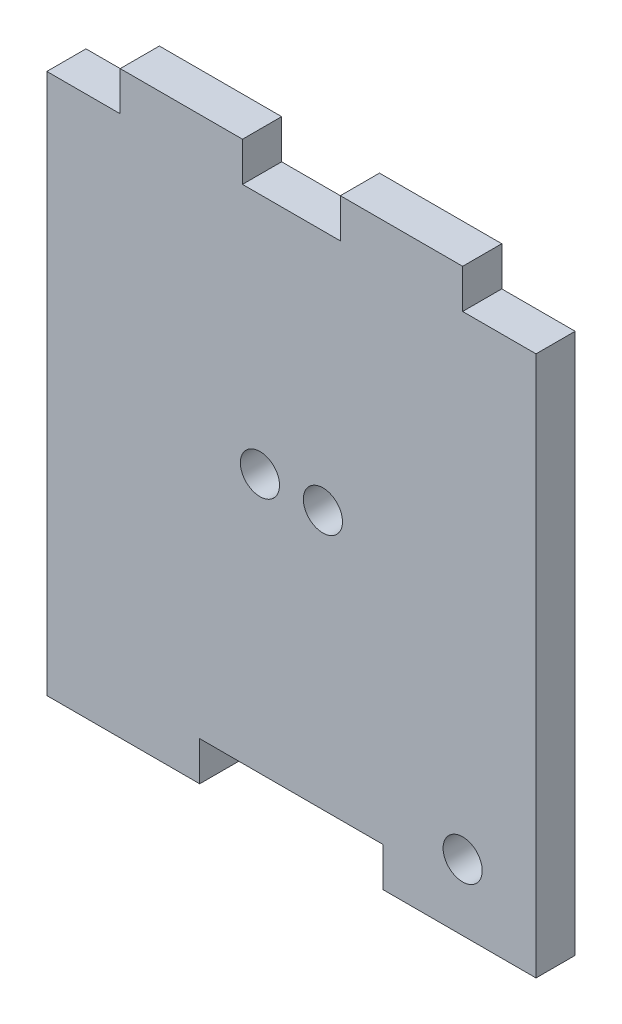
ISO-10303-21;
HEADER;
FILE_DESCRIPTION(('STEP AP214'),'2;1');
FILE_NAME('part.step','',(''),(''),'','','');
FILE_SCHEMA(('AUTOMOTIVE_DESIGN { 1 0 10303 214 1 1 1 1 }'));
ENDSEC;
DATA;
#1=APPLICATION_CONTEXT('core data for automotive mechanical design processes');
#2=APPLICATION_PROTOCOL_DEFINITION('international standard','automotive_design',2000,#1);
#3=PRODUCT_CONTEXT('',#1,'mechanical');
#4=PRODUCT('Part','Part','',(#3));
#5=PRODUCT_RELATED_PRODUCT_CATEGORY('part','',(#4));
#6=PRODUCT_DEFINITION_FORMATION('','',#4);
#7=PRODUCT_DEFINITION_CONTEXT('part definition',#1,'design');
#8=PRODUCT_DEFINITION('design','',#6,#7);
#9=PRODUCT_DEFINITION_SHAPE('','',#8);
#10=(LENGTH_UNIT() NAMED_UNIT(*) SI_UNIT(.MILLI.,.METRE.));
#11=(NAMED_UNIT(*) PLANE_ANGLE_UNIT() SI_UNIT($,.RADIAN.));
#12=(NAMED_UNIT(*) SI_UNIT($,.STERADIAN.) SOLID_ANGLE_UNIT());
#13=UNCERTAINTY_MEASURE_WITH_UNIT(LENGTH_MEASURE(1.E-05),#10,'distance_accuracy_value','');
#14=(GEOMETRIC_REPRESENTATION_CONTEXT(3) GLOBAL_UNCERTAINTY_ASSIGNED_CONTEXT((#13)) GLOBAL_UNIT_ASSIGNED_CONTEXT((#10,
#11,#12)) REPRESENTATION_CONTEXT('',''));
#15=CARTESIAN_POINT('',(0.,0.,0.));
#16=DIRECTION('',(0.,0.,1.));
#17=DIRECTION('',(1.,0.,0.));
#18=AXIS2_PLACEMENT_3D('',#15,#16,#17);
#19=CARTESIAN_POINT('',(30.,0.,16.));
#20=DIRECTION('',(-1.,0.,0.));
#21=DIRECTION('',(0.,0.,1.));
#22=AXIS2_PLACEMENT_3D('',#19,#20,#21);
#23=PLANE('',#22);
#24=DIRECTION('',(0.,1.,0.));
#25=VECTOR('',#24,1.);
#26=CARTESIAN_POINT('',(30.,0.,0.));
#27=LINE('',#26,#25);
#28=CARTESIAN_POINT('',(30.,221.,0.));
#29=VERTEX_POINT('',#28);
#30=CARTESIAN_POINT('',(30.,237.,0.));
#31=VERTEX_POINT('',#30);
#32=EDGE_CURVE('E240',#29,#31,#27,.T.);
#33=ORIENTED_EDGE('',*,*,#32,.F.);
#34=DIRECTION('',(0.,0.,-1.));
#35=VECTOR('',#34,1.);
#36=CARTESIAN_POINT('',(30.,221.,16.));
#37=LINE('',#36,#35);
#38=CARTESIAN_POINT('',(30.,221.,16.));
#39=VERTEX_POINT('',#38);
#40=EDGE_CURVE('E11',#39,#29,#37,.T.);
#41=ORIENTED_EDGE('',*,*,#40,.F.);
#42=DIRECTION('',(0.,1.,0.));
#43=VECTOR('',#42,1.);
#44=CARTESIAN_POINT('',(30.,0.,16.));
#45=LINE('',#44,#43);
#46=CARTESIAN_POINT('',(30.,237.,16.));
#47=VERTEX_POINT('',#46);
#48=EDGE_CURVE('E186',#39,#47,#45,.T.);
#49=ORIENTED_EDGE('',*,*,#48,.T.);
#50=DIRECTION('',(0.,0.,-1.));
#51=VECTOR('',#50,1.);
#52=CARTESIAN_POINT('',(30.,237.,16.));
#53=LINE('',#52,#51);
#54=EDGE_CURVE('E53',#47,#31,#53,.T.);
#55=ORIENTED_EDGE('',*,*,#54,.T.);
#56=EDGE_LOOP('',(#33,#41,#49,#55));
#57=FACE_BOUND('',#56,.T.);
#58=ADVANCED_FACE('F37',(#57),#23,.T.);
#59=CARTESIAN_POINT('',(0.,221.,16.));
#60=DIRECTION('',(0.,1.,0.));
#61=DIRECTION('',(0.,0.,1.));
#62=AXIS2_PLACEMENT_3D('',#59,#60,#61);
#63=PLANE('',#62);
#64=DIRECTION('',(1.,0.,0.));
#65=VECTOR('',#64,1.);
#66=CARTESIAN_POINT('',(0.,221.,0.));
#67=LINE('',#66,#65);
#68=CARTESIAN_POINT('',(0.,221.,0.));
#69=VERTEX_POINT('',#68);
#70=EDGE_CURVE('E237',#69,#29,#67,.T.);
#71=ORIENTED_EDGE('',*,*,#70,.F.);
#72=DIRECTION('',(0.,0.,-1.));
#73=VECTOR('',#72,1.);
#74=CARTESIAN_POINT('',(0.,221.,16.));
#75=LINE('',#74,#73);
#76=CARTESIAN_POINT('',(0.,221.,16.));
#77=VERTEX_POINT('',#76);
#78=EDGE_CURVE('E45',#77,#69,#75,.T.);
#79=ORIENTED_EDGE('',*,*,#78,.F.);
#80=DIRECTION('',(1.,0.,0.));
#81=VECTOR('',#80,1.);
#82=CARTESIAN_POINT('',(0.,221.,16.));
#83=LINE('',#82,#81);
#84=EDGE_CURVE('E176',#77,#39,#83,.T.);
#85=ORIENTED_EDGE('',*,*,#84,.T.);
#86=ORIENTED_EDGE('',*,*,#40,.T.);
#87=EDGE_LOOP('',(#71,#79,#85,#86));
#88=FACE_BOUND('',#87,.T.);
#89=ADVANCED_FACE('F238',(#88),#63,.T.);
#90=CARTESIAN_POINT('',(0.,0.,16.));
#91=DIRECTION('',(-1.,0.,0.));
#92=DIRECTION('',(0.,0.,1.));
#93=AXIS2_PLACEMENT_3D('',#90,#91,#92);
#94=PLANE('',#93);
#95=DIRECTION('',(0.,1.,0.));
#96=VECTOR('',#95,1.);
#97=CARTESIAN_POINT('',(0.,0.,0.));
#98=LINE('',#97,#96);
#99=CARTESIAN_POINT('',(0.,0.,0.));
#100=VERTEX_POINT('',#99);
#101=EDGE_CURVE('E234',#100,#69,#98,.T.);
#102=ORIENTED_EDGE('',*,*,#101,.F.);
#103=DIRECTION('',(0.,0.,-1.));
#104=VECTOR('',#103,1.);
#105=CARTESIAN_POINT('',(0.,0.,16.));
#106=LINE('',#105,#104);
#107=CARTESIAN_POINT('',(0.,0.,16.));
#108=VERTEX_POINT('',#107);
#109=EDGE_CURVE('E228',#108,#100,#106,.T.);
#110=ORIENTED_EDGE('',*,*,#109,.F.);
#111=DIRECTION('',(0.,1.,0.));
#112=VECTOR('',#111,1.);
#113=CARTESIAN_POINT('',(0.,0.,16.));
#114=LINE('',#113,#112);
#115=EDGE_CURVE('E185',#108,#77,#114,.T.);
#116=ORIENTED_EDGE('',*,*,#115,.T.);
#117=ORIENTED_EDGE('',*,*,#78,.T.);
#118=EDGE_LOOP('',(#102,#110,#116,#117));
#119=FACE_BOUND('',#118,.T.);
#120=ADVANCED_FACE('F232',(#119),#94,.T.);
#121=CARTESIAN_POINT('',(0.,0.,16.));
#122=DIRECTION('',(0.,1.,0.));
#123=DIRECTION('',(0.,0.,1.));
#124=AXIS2_PLACEMENT_3D('',#121,#122,#123);
#125=PLANE('',#124);
#126=DIRECTION('',(1.,0.,0.));
#127=VECTOR('',#126,1.);
#128=CARTESIAN_POINT('',(0.,0.,0.));
#129=LINE('',#128,#127);
#130=CARTESIAN_POINT('',(62.5,0.,0.));
#131=VERTEX_POINT('',#130);
#132=EDGE_CURVE('E247',#100,#131,#129,.T.);
#133=ORIENTED_EDGE('',*,*,#132,.T.);
#134=DIRECTION('',(0.,0.,-1.));
#135=VECTOR('',#134,1.);
#136=CARTESIAN_POINT('',(62.5,0.,16.));
#137=LINE('',#136,#135);
#138=CARTESIAN_POINT('',(62.5,0.,16.));
#139=VERTEX_POINT('',#138);
#140=EDGE_CURVE('E225',#139,#131,#137,.T.);
#141=ORIENTED_EDGE('',*,*,#140,.F.);
#142=DIRECTION('',(1.,0.,0.));
#143=VECTOR('',#142,1.);
#144=CARTESIAN_POINT('',(0.,0.,16.));
#145=LINE('',#144,#143);
#146=EDGE_CURVE('E190',#108,#139,#145,.T.);
#147=ORIENTED_EDGE('',*,*,#146,.F.);
#148=ORIENTED_EDGE('',*,*,#109,.T.);
#149=EDGE_LOOP('',(#133,#141,#147,#148));
#150=FACE_BOUND('',#149,.T.);
#151=ADVANCED_FACE('F328',(#150),#125,.F.);
#152=CARTESIAN_POINT('',(62.5,0.,16.));
#153=DIRECTION('',(-1.,0.,0.));
#154=DIRECTION('',(0.,0.,1.));
#155=AXIS2_PLACEMENT_3D('',#152,#153,#154);
#156=PLANE('',#155);
#157=DIRECTION('',(0.,1.,0.));
#158=VECTOR('',#157,1.);
#159=CARTESIAN_POINT('',(62.5,0.,0.));
#160=LINE('',#159,#158);
#161=CARTESIAN_POINT('',(62.5,16.,0.));
#162=VERTEX_POINT('',#161);
#163=EDGE_CURVE('E249',#131,#162,#160,.T.);
#164=ORIENTED_EDGE('',*,*,#163,.T.);
#165=DIRECTION('',(0.,0.,-1.));
#166=VECTOR('',#165,1.);
#167=CARTESIAN_POINT('',(62.5,16.,16.));
#168=LINE('',#167,#166);
#169=CARTESIAN_POINT('',(62.5,16.,16.));
#170=VERTEX_POINT('',#169);
#171=EDGE_CURVE('E222',#170,#162,#168,.T.);
#172=ORIENTED_EDGE('',*,*,#171,.F.);
#173=DIRECTION('',(0.,1.,0.));
#174=VECTOR('',#173,1.);
#175=CARTESIAN_POINT('',(62.5,0.,16.));
#176=LINE('',#175,#174);
#177=EDGE_CURVE('E321',#139,#170,#176,.T.);
#178=ORIENTED_EDGE('',*,*,#177,.F.);
#179=ORIENTED_EDGE('',*,*,#140,.T.);
#180=EDGE_LOOP('',(#164,#172,#178,#179));
#181=FACE_BOUND('',#180,.T.);
#182=ADVANCED_FACE('F330',(#181),#156,.F.);
#183=CARTESIAN_POINT('',(0.,16.,16.));
#184=DIRECTION('',(0.,1.,0.));
#185=DIRECTION('',(0.,0.,1.));
#186=AXIS2_PLACEMENT_3D('',#183,#184,#185);
#187=PLANE('',#186);
#188=DIRECTION('',(1.,0.,0.));
#189=VECTOR('',#188,1.);
#190=CARTESIAN_POINT('',(0.,16.,0.));
#191=LINE('',#190,#189);
#192=CARTESIAN_POINT('',(137.5,16.,0.));
#193=VERTEX_POINT('',#192);
#194=EDGE_CURVE('E254',#162,#193,#191,.T.);
#195=ORIENTED_EDGE('',*,*,#194,.T.);
#196=DIRECTION('',(0.,0.,-1.));
#197=VECTOR('',#196,1.);
#198=CARTESIAN_POINT('',(137.5,16.,16.));
#199=LINE('',#198,#197);
#200=CARTESIAN_POINT('',(137.5,16.,16.));
#201=VERTEX_POINT('',#200);
#202=EDGE_CURVE('E220',#201,#193,#199,.T.);
#203=ORIENTED_EDGE('',*,*,#202,.F.);
#204=DIRECTION('',(1.,0.,0.));
#205=VECTOR('',#204,1.);
#206=CARTESIAN_POINT('',(0.,16.,16.));
#207=LINE('',#206,#205);
#208=EDGE_CURVE('E319',#170,#201,#207,.T.);
#209=ORIENTED_EDGE('',*,*,#208,.F.);
#210=ORIENTED_EDGE('',*,*,#171,.T.);
#211=EDGE_LOOP('',(#195,#203,#209,#210));
#212=FACE_BOUND('',#211,.T.);
#213=ADVANCED_FACE('F335',(#212),#187,.F.);
#214=CARTESIAN_POINT('',(137.5,0.,16.));
#215=DIRECTION('',(-1.,0.,0.));
#216=DIRECTION('',(0.,0.,1.));
#217=AXIS2_PLACEMENT_3D('',#214,#215,#216);
#218=PLANE('',#217);
#219=DIRECTION('',(0.,1.,0.));
#220=VECTOR('',#219,1.);
#221=CARTESIAN_POINT('',(137.5,0.,0.));
#222=LINE('',#221,#220);
#223=CARTESIAN_POINT('',(137.5,0.,0.));
#224=VERTEX_POINT('',#223);
#225=EDGE_CURVE('E257',#224,#193,#222,.T.);
#226=ORIENTED_EDGE('',*,*,#225,.F.);
#227=DIRECTION('',(0.,0.,-1.));
#228=VECTOR('',#227,1.);
#229=CARTESIAN_POINT('',(137.5,0.,16.));
#230=LINE('',#229,#228);
#231=CARTESIAN_POINT('',(137.5,0.,16.));
#232=VERTEX_POINT('',#231);
#233=EDGE_CURVE('E218',#232,#224,#230,.T.);
#234=ORIENTED_EDGE('',*,*,#233,.F.);
#235=DIRECTION('',(0.,1.,0.));
#236=VECTOR('',#235,1.);
#237=CARTESIAN_POINT('',(137.5,0.,16.));
#238=LINE('',#237,#236);
#239=EDGE_CURVE('E316',#232,#201,#238,.T.);
#240=ORIENTED_EDGE('',*,*,#239,.T.);
#241=ORIENTED_EDGE('',*,*,#202,.T.);
#242=EDGE_LOOP('',(#226,#234,#240,#241));
#243=FACE_BOUND('',#242,.T.);
#244=ADVANCED_FACE('F341',(#243),#218,.T.);
#245=CARTESIAN_POINT('',(0.,0.,16.));
#246=DIRECTION('',(0.,1.,0.));
#247=DIRECTION('',(0.,0.,1.));
#248=AXIS2_PLACEMENT_3D('',#245,#246,#247);
#249=PLANE('',#248);
#250=DIRECTION('',(1.,0.,0.));
#251=VECTOR('',#250,1.);
#252=CARTESIAN_POINT('',(0.,0.,0.));
#253=LINE('',#252,#251);
#254=CARTESIAN_POINT('',(200.,0.,0.));
#255=VERTEX_POINT('',#254);
#256=EDGE_CURVE('E260',#224,#255,#253,.T.);
#257=ORIENTED_EDGE('',*,*,#256,.T.);
#258=DIRECTION('',(0.,0.,-1.));
#259=VECTOR('',#258,1.);
#260=CARTESIAN_POINT('',(200.,0.,16.));
#261=LINE('',#260,#259);
#262=CARTESIAN_POINT('',(200.,0.,16.));
#263=VERTEX_POINT('',#262);
#264=EDGE_CURVE('E215',#263,#255,#261,.T.);
#265=ORIENTED_EDGE('',*,*,#264,.F.);
#266=DIRECTION('',(1.,0.,0.));
#267=VECTOR('',#266,1.);
#268=CARTESIAN_POINT('',(0.,0.,16.));
#269=LINE('',#268,#267);
#270=EDGE_CURVE('E314',#232,#263,#269,.T.);
#271=ORIENTED_EDGE('',*,*,#270,.F.);
#272=ORIENTED_EDGE('',*,*,#233,.T.);
#273=EDGE_LOOP('',(#257,#265,#271,#272));
#274=FACE_BOUND('',#273,.T.);
#275=ADVANCED_FACE('F344',(#274),#249,.F.);
#276=CARTESIAN_POINT('',(200.,0.,16.));
#277=DIRECTION('',(-1.,0.,0.));
#278=DIRECTION('',(0.,-1.,0.));
#279=AXIS2_PLACEMENT_3D('',#276,#277,#278);
#280=PLANE('',#279);
#281=DIRECTION('',(0.,1.,0.));
#282=VECTOR('',#281,1.);
#283=CARTESIAN_POINT('',(200.,0.,0.));
#284=LINE('',#283,#282);
#285=CARTESIAN_POINT('',(200.,221.,0.));
#286=VERTEX_POINT('',#285);
#287=EDGE_CURVE('E262',#255,#286,#284,.T.);
#288=ORIENTED_EDGE('',*,*,#287,.T.);
#289=DIRECTION('',(0.,0.,-1.));
#290=VECTOR('',#289,1.);
#291=CARTESIAN_POINT('',(200.,221.,16.));
#292=LINE('',#291,#290);
#293=CARTESIAN_POINT('',(200.,221.,16.));
#294=VERTEX_POINT('',#293);
#295=EDGE_CURVE('E213',#294,#286,#292,.T.);
#296=ORIENTED_EDGE('',*,*,#295,.F.);
#297=DIRECTION('',(0.,1.,0.));
#298=VECTOR('',#297,1.);
#299=CARTESIAN_POINT('',(200.,0.,16.));
#300=LINE('',#299,#298);
#301=EDGE_CURVE('E183',#263,#294,#300,.T.);
#302=ORIENTED_EDGE('',*,*,#301,.F.);
#303=ORIENTED_EDGE('',*,*,#264,.T.);
#304=EDGE_LOOP('',(#288,#296,#302,#303));
#305=FACE_BOUND('',#304,.T.);
#306=ADVANCED_FACE('F349',(#305),#280,.F.);
#307=CARTESIAN_POINT('',(170.,221.,0.));
#308=VERTEX_POINT('',#307);
#309=EDGE_CURVE('E242',#308,#286,#67,.T.);
#310=ORIENTED_EDGE('',*,*,#309,.F.);
#311=DIRECTION('',(0.,0.,-1.));
#312=VECTOR('',#311,1.);
#313=CARTESIAN_POINT('',(170.,221.,16.));
#314=LINE('',#313,#312);
#315=CARTESIAN_POINT('',(170.,221.,16.));
#316=VERTEX_POINT('',#315);
#317=EDGE_CURVE('E211',#316,#308,#314,.T.);
#318=ORIENTED_EDGE('',*,*,#317,.F.);
#319=EDGE_CURVE('E175',#316,#294,#83,.T.);
#320=ORIENTED_EDGE('',*,*,#319,.T.);
#321=ORIENTED_EDGE('',*,*,#295,.T.);
#322=EDGE_LOOP('',(#310,#318,#320,#321));
#323=FACE_BOUND('',#322,.T.);
#324=ADVANCED_FACE('F301',(#323),#63,.T.);
#325=CARTESIAN_POINT('',(170.,0.,16.));
#326=DIRECTION('',(-1.,0.,0.));
#327=DIRECTION('',(0.,0.,1.));
#328=AXIS2_PLACEMENT_3D('',#325,#326,#327);
#329=PLANE('',#328);
#330=DIRECTION('',(0.,1.,0.));
#331=VECTOR('',#330,1.);
#332=CARTESIAN_POINT('',(170.,0.,0.));
#333=LINE('',#332,#331);
#334=CARTESIAN_POINT('',(170.,237.,0.));
#335=VERTEX_POINT('',#334);
#336=EDGE_CURVE('E265',#308,#335,#333,.T.);
#337=ORIENTED_EDGE('',*,*,#336,.T.);
#338=DIRECTION('',(0.,0.,-1.));
#339=VECTOR('',#338,1.);
#340=CARTESIAN_POINT('',(170.,237.,16.));
#341=LINE('',#340,#339);
#342=CARTESIAN_POINT('',(170.,237.,16.));
#343=VERTEX_POINT('',#342);
#344=EDGE_CURVE('E208',#343,#335,#341,.T.);
#345=ORIENTED_EDGE('',*,*,#344,.F.);
#346=DIRECTION('',(0.,1.,0.));
#347=VECTOR('',#346,1.);
#348=CARTESIAN_POINT('',(170.,0.,16.));
#349=LINE('',#348,#347);
#350=EDGE_CURVE('E182',#316,#343,#349,.T.);
#351=ORIENTED_EDGE('',*,*,#350,.F.);
#352=ORIENTED_EDGE('',*,*,#317,.T.);
#353=EDGE_LOOP('',(#337,#345,#351,#352));
#354=FACE_BOUND('',#353,.T.);
#355=ADVANCED_FACE('F358',(#354),#329,.F.);
#356=CARTESIAN_POINT('',(0.,237.,16.));
#357=DIRECTION('',(0.,-1.,0.));
#358=DIRECTION('',(0.,0.,-1.));
#359=AXIS2_PLACEMENT_3D('',#356,#357,#358);
#360=PLANE('',#359);
#361=DIRECTION('',(-1.,0.,0.));
#362=VECTOR('',#361,1.);
#363=CARTESIAN_POINT('',(0.,237.,0.));
#364=LINE('',#363,#362);
#365=CARTESIAN_POINT('',(120.,237.,0.));
#366=VERTEX_POINT('',#365);
#367=EDGE_CURVE('E267',#335,#366,#364,.T.);
#368=ORIENTED_EDGE('',*,*,#367,.T.);
#369=DIRECTION('',(0.,0.,-1.));
#370=VECTOR('',#369,1.);
#371=CARTESIAN_POINT('',(120.,237.,16.));
#372=LINE('',#371,#370);
#373=CARTESIAN_POINT('',(120.,237.,16.));
#374=VERTEX_POINT('',#373);
#375=EDGE_CURVE('E206',#374,#366,#372,.T.);
#376=ORIENTED_EDGE('',*,*,#375,.F.);
#377=DIRECTION('',(-1.,0.,0.));
#378=VECTOR('',#377,1.);
#379=CARTESIAN_POINT('',(0.,237.,16.));
#380=LINE('',#379,#378);
#381=EDGE_CURVE('E177',#343,#374,#380,.T.);
#382=ORIENTED_EDGE('',*,*,#381,.F.);
#383=ORIENTED_EDGE('',*,*,#344,.T.);
#384=EDGE_LOOP('',(#368,#376,#382,#383));
#385=FACE_BOUND('',#384,.T.);
#386=ADVANCED_FACE('F363',(#385),#360,.F.);
#387=CARTESIAN_POINT('',(120.,0.,16.));
#388=DIRECTION('',(-1.,0.,0.));
#389=DIRECTION('',(0.,0.,1.));
#390=AXIS2_PLACEMENT_3D('',#387,#388,#389);
#391=PLANE('',#390);
#392=DIRECTION('',(0.,1.,0.));
#393=VECTOR('',#392,1.);
#394=CARTESIAN_POINT('',(120.,0.,0.));
#395=LINE('',#394,#393);
#396=CARTESIAN_POINT('',(120.,221.,0.));
#397=VERTEX_POINT('',#396);
#398=EDGE_CURVE('E270',#397,#366,#395,.T.);
#399=ORIENTED_EDGE('',*,*,#398,.F.);
#400=DIRECTION('',(0.,0.,-1.));
#401=VECTOR('',#400,1.);
#402=CARTESIAN_POINT('',(120.,221.,16.));
#403=LINE('',#402,#401);
#404=CARTESIAN_POINT('',(120.,221.,16.));
#405=VERTEX_POINT('',#404);
#406=EDGE_CURVE('E161',#405,#397,#403,.T.);
#407=ORIENTED_EDGE('',*,*,#406,.F.);
#408=DIRECTION('',(0.,1.,0.));
#409=VECTOR('',#408,1.);
#410=CARTESIAN_POINT('',(120.,0.,16.));
#411=LINE('',#410,#409);
#412=EDGE_CURVE('E173',#405,#374,#411,.T.);
#413=ORIENTED_EDGE('',*,*,#412,.T.);
#414=ORIENTED_EDGE('',*,*,#375,.T.);
#415=EDGE_LOOP('',(#399,#407,#413,#414));
#416=FACE_BOUND('',#415,.T.);
#417=ADVANCED_FACE('F366',(#416),#391,.T.);
#418=CARTESIAN_POINT('',(80.,221.,0.));
#419=VERTEX_POINT('',#418);
#420=EDGE_CURVE('E158',#419,#397,#67,.T.);
#421=ORIENTED_EDGE('',*,*,#420,.F.);
#422=DIRECTION('',(0.,0.,-1.));
#423=VECTOR('',#422,1.);
#424=CARTESIAN_POINT('',(80.,221.,16.));
#425=LINE('',#424,#423);
#426=CARTESIAN_POINT('',(80.,221.,16.));
#427=VERTEX_POINT('',#426);
#428=EDGE_CURVE('E152',#427,#419,#425,.T.);
#429=ORIENTED_EDGE('',*,*,#428,.F.);
#430=EDGE_CURVE('E156',#427,#405,#83,.T.);
#431=ORIENTED_EDGE('',*,*,#430,.T.);
#432=ORIENTED_EDGE('',*,*,#406,.T.);
#433=EDGE_LOOP('',(#421,#429,#431,#432));
#434=FACE_BOUND('',#433,.T.);
#435=ADVANCED_FACE('F154',(#434),#63,.T.);
#436=CARTESIAN_POINT('',(80.,0.,16.));
#437=DIRECTION('',(-1.,0.,0.));
#438=DIRECTION('',(0.,0.,1.));
#439=AXIS2_PLACEMENT_3D('',#436,#437,#438);
#440=PLANE('',#439);
#441=DIRECTION('',(0.,1.,0.));
#442=VECTOR('',#441,1.);
#443=CARTESIAN_POINT('',(80.,0.,0.));
#444=LINE('',#443,#442);
#445=CARTESIAN_POINT('',(80.,237.,0.));
#446=VERTEX_POINT('',#445);
#447=EDGE_CURVE('E273',#419,#446,#444,.T.);
#448=ORIENTED_EDGE('',*,*,#447,.T.);
#449=DIRECTION('',(0.,0.,-1.));
#450=VECTOR('',#449,1.);
#451=CARTESIAN_POINT('',(80.,237.,16.));
#452=LINE('',#451,#450);
#453=CARTESIAN_POINT('',(80.,237.,16.));
#454=VERTEX_POINT('',#453);
#455=EDGE_CURVE('E103',#454,#446,#452,.T.);
#456=ORIENTED_EDGE('',*,*,#455,.F.);
#457=DIRECTION('',(0.,1.,0.));
#458=VECTOR('',#457,1.);
#459=CARTESIAN_POINT('',(80.,0.,16.));
#460=LINE('',#459,#458);
#461=EDGE_CURVE('E163',#427,#454,#460,.T.);
#462=ORIENTED_EDGE('',*,*,#461,.F.);
#463=ORIENTED_EDGE('',*,*,#428,.T.);
#464=EDGE_LOOP('',(#448,#456,#462,#463));
#465=FACE_BOUND('',#464,.T.);
#466=ADVANCED_FACE('F164',(#465),#440,.F.);
#467=CARTESIAN_POINT('',(112.87,122.,16.));
#468=DIRECTION('',(0.,0.,-1.));
#469=DIRECTION('',(-1.,0.,0.));
#470=AXIS2_PLACEMENT_3D('',#467,#468,#469);
#471=CYLINDRICAL_SURFACE('',#470,8.00000000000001);
#472=CARTESIAN_POINT('',(112.87,122.,16.));
#473=DIRECTION('',(0.,0.,1.));
#474=DIRECTION('',(1.,0.,0.));
#475=AXIS2_PLACEMENT_3D('',#472,#473,#474);
#476=CIRCLE('',#475,8.00000000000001);
#477=CARTESIAN_POINT('',(120.87,122.,16.));
#478=VERTEX_POINT('',#477);
#479=EDGE_CURVE('E305',#478,#478,#476,.T.);
#480=ORIENTED_EDGE('',*,*,#479,.T.);
#481=EDGE_LOOP('',(#480));
#482=FACE_BOUND('',#481,.T.);
#483=CARTESIAN_POINT('',(112.87,122.,0.));
#484=DIRECTION('',(0.,0.,1.));
#485=DIRECTION('',(1.,0.,0.));
#486=AXIS2_PLACEMENT_3D('',#483,#484,#485);
#487=CIRCLE('',#486,8.00000000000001);
#488=CARTESIAN_POINT('',(120.87,122.,0.));
#489=VERTEX_POINT('',#488);
#490=EDGE_CURVE('E193',#489,#489,#487,.T.);
#491=ORIENTED_EDGE('',*,*,#490,.F.);
#492=EDGE_LOOP('',(#491));
#493=FACE_BOUND('',#492,.T.);
#494=ADVANCED_FACE('F284',(#482,#493),#471,.F.);
#495=CARTESIAN_POINT('',(87.13,122.,16.));
#496=DIRECTION('',(0.,0.,-1.));
#497=DIRECTION('',(-1.,0.,0.));
#498=AXIS2_PLACEMENT_3D('',#495,#496,#497);
#499=CYLINDRICAL_SURFACE('',#498,8.00000000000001);
#500=CARTESIAN_POINT('',(87.13,122.,16.));
#501=DIRECTION('',(0.,0.,1.));
#502=DIRECTION('',(1.,0.,0.));
#503=AXIS2_PLACEMENT_3D('',#500,#501,#502);
#504=CIRCLE('',#503,8.00000000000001);
#505=CARTESIAN_POINT('',(95.13,122.,16.));
#506=VERTEX_POINT('',#505);
#507=EDGE_CURVE('E308',#506,#506,#504,.T.);
#508=ORIENTED_EDGE('',*,*,#507,.T.);
#509=EDGE_LOOP('',(#508));
#510=FACE_BOUND('',#509,.T.);
#511=CARTESIAN_POINT('',(87.13,122.,0.));
#512=DIRECTION('',(0.,0.,1.));
#513=DIRECTION('',(1.,0.,0.));
#514=AXIS2_PLACEMENT_3D('',#511,#512,#513);
#515=CIRCLE('',#514,8.00000000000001);
#516=CARTESIAN_POINT('',(95.13,122.,0.));
#517=VERTEX_POINT('',#516);
#518=EDGE_CURVE('E198',#517,#517,#515,.T.);
#519=ORIENTED_EDGE('',*,*,#518,.F.);
#520=EDGE_LOOP('',(#519));
#521=FACE_BOUND('',#520,.T.);
#522=ADVANCED_FACE('F281',(#510,#521),#499,.F.);
#523=CARTESIAN_POINT('',(0.,237.,16.));
#524=DIRECTION('',(0.,1.,0.));
#525=DIRECTION('',(0.,0.,1.));
#526=AXIS2_PLACEMENT_3D('',#523,#524,#525);
#527=PLANE('',#526);
#528=DIRECTION('',(1.,0.,0.));
#529=VECTOR('',#528,1.);
#530=CARTESIAN_POINT('',(0.,237.,0.));
#531=LINE('',#530,#529);
#532=EDGE_CURVE('E275',#31,#446,#531,.T.);
#533=ORIENTED_EDGE('',*,*,#532,.F.);
#534=ORIENTED_EDGE('',*,*,#54,.F.);
#535=DIRECTION('',(1.,0.,0.));
#536=VECTOR('',#535,1.);
#537=CARTESIAN_POINT('',(0.,237.,16.));
#538=LINE('',#537,#536);
#539=EDGE_CURVE('E167',#47,#454,#538,.T.);
#540=ORIENTED_EDGE('',*,*,#539,.T.);
#541=ORIENTED_EDGE('',*,*,#455,.T.);
#542=EDGE_LOOP('',(#533,#534,#540,#541));
#543=FACE_BOUND('',#542,.T.);
#544=ADVANCED_FACE('F283',(#543),#527,.T.);
#545=CARTESIAN_POINT('',(170.,27.,16.));
#546=DIRECTION('',(0.,0.,-1.));
#547=DIRECTION('',(-1.,0.,0.));
#548=AXIS2_PLACEMENT_3D('',#545,#546,#547);
#549=CYLINDRICAL_SURFACE('',#548,8.00000000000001);
#550=CARTESIAN_POINT('',(170.,27.,16.));
#551=DIRECTION('',(0.,0.,1.));
#552=DIRECTION('',(1.,0.,0.));
#553=AXIS2_PLACEMENT_3D('',#550,#551,#552);
#554=CIRCLE('',#553,8.00000000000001);
#555=CARTESIAN_POINT('',(178.,27.,16.));
#556=VERTEX_POINT('',#555);
#557=EDGE_CURVE('E203',#556,#556,#554,.T.);
#558=ORIENTED_EDGE('',*,*,#557,.T.);
#559=EDGE_LOOP('',(#558));
#560=FACE_BOUND('',#559,.T.);
#561=CARTESIAN_POINT('',(170.,27.,0.));
#562=DIRECTION('',(0.,0.,1.));
#563=DIRECTION('',(1.,0.,0.));
#564=AXIS2_PLACEMENT_3D('',#561,#562,#563);
#565=CIRCLE('',#564,8.00000000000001);
#566=CARTESIAN_POINT('',(178.,27.,0.));
#567=VERTEX_POINT('',#566);
#568=EDGE_CURVE('E191',#567,#567,#565,.T.);
#569=ORIENTED_EDGE('',*,*,#568,.F.);
#570=EDGE_LOOP('',(#569));
#571=FACE_BOUND('',#570,.T.);
#572=ADVANCED_FACE('F291',(#560,#571),#549,.F.);
#573=CARTESIAN_POINT('',(0.,0.,16.));
#574=DIRECTION('',(0.,0.,1.));
#575=DIRECTION('',(1.,0.,0.));
#576=AXIS2_PLACEMENT_3D('',#573,#574,#575);
#577=PLANE('',#576);
#578=ORIENTED_EDGE('',*,*,#48,.F.);
#579=ORIENTED_EDGE('',*,*,#84,.F.);
#580=ORIENTED_EDGE('',*,*,#115,.F.);
#581=ORIENTED_EDGE('',*,*,#146,.T.);
#582=ORIENTED_EDGE('',*,*,#177,.T.);
#583=ORIENTED_EDGE('',*,*,#208,.T.);
#584=ORIENTED_EDGE('',*,*,#239,.F.);
#585=ORIENTED_EDGE('',*,*,#270,.T.);
#586=ORIENTED_EDGE('',*,*,#301,.T.);
#587=ORIENTED_EDGE('',*,*,#319,.F.);
#588=ORIENTED_EDGE('',*,*,#350,.T.);
#589=ORIENTED_EDGE('',*,*,#381,.T.);
#590=ORIENTED_EDGE('',*,*,#412,.F.);
#591=ORIENTED_EDGE('',*,*,#430,.F.);
#592=ORIENTED_EDGE('',*,*,#461,.T.);
#593=ORIENTED_EDGE('',*,*,#539,.F.);
#594=EDGE_LOOP('',(#578,#579,#580,#581,#582,#583,#584,#585,#586,#587,#588,#589,#590,#591,#592,#593));
#595=FACE_BOUND('',#594,.T.);
#596=ORIENTED_EDGE('',*,*,#507,.F.);
#597=EDGE_LOOP('',(#596));
#598=FACE_BOUND('',#597,.T.);
#599=ORIENTED_EDGE('',*,*,#479,.F.);
#600=EDGE_LOOP('',(#599));
#601=FACE_BOUND('',#600,.T.);
#602=ORIENTED_EDGE('',*,*,#557,.F.);
#603=EDGE_LOOP('',(#602));
#604=FACE_BOUND('',#603,.T.);
#605=ADVANCED_FACE('F170',(#595,#598,#601,#604),#577,.T.);
#606=CARTESIAN_POINT('',(0.,0.,0.));
#607=DIRECTION('',(0.,0.,1.));
#608=DIRECTION('',(1.,0.,0.));
#609=AXIS2_PLACEMENT_3D('',#606,#607,#608);
#610=PLANE('',#609);
#611=ORIENTED_EDGE('',*,*,#32,.T.);
#612=ORIENTED_EDGE('',*,*,#532,.T.);
#613=ORIENTED_EDGE('',*,*,#447,.F.);
#614=ORIENTED_EDGE('',*,*,#420,.T.);
#615=ORIENTED_EDGE('',*,*,#398,.T.);
#616=ORIENTED_EDGE('',*,*,#367,.F.);
#617=ORIENTED_EDGE('',*,*,#336,.F.);
#618=ORIENTED_EDGE('',*,*,#309,.T.);
#619=ORIENTED_EDGE('',*,*,#287,.F.);
#620=ORIENTED_EDGE('',*,*,#256,.F.);
#621=ORIENTED_EDGE('',*,*,#225,.T.);
#622=ORIENTED_EDGE('',*,*,#194,.F.);
#623=ORIENTED_EDGE('',*,*,#163,.F.);
#624=ORIENTED_EDGE('',*,*,#132,.F.);
#625=ORIENTED_EDGE('',*,*,#101,.T.);
#626=ORIENTED_EDGE('',*,*,#70,.T.);
#627=EDGE_LOOP('',(#611,#612,#613,#614,#615,#616,#617,#618,#619,#620,#621,#622,#623,#624,#625,#626));
#628=FACE_BOUND('',#627,.T.);
#629=ORIENTED_EDGE('',*,*,#518,.T.);
#630=EDGE_LOOP('',(#629));
#631=FACE_BOUND('',#630,.T.);
#632=ORIENTED_EDGE('',*,*,#490,.T.);
#633=EDGE_LOOP('',(#632));
#634=FACE_BOUND('',#633,.T.);
#635=ORIENTED_EDGE('',*,*,#568,.T.);
#636=EDGE_LOOP('',(#635));
#637=FACE_BOUND('',#636,.T.);
#638=ADVANCED_FACE('F244',(#628,#631,#634,#637),#610,.F.);
#639=CLOSED_SHELL('',(#58,#89,#120,#151,#182,#213,#244,#275,#306,#324,#355,#386,#417,#435,#466,
#494,#522,#544,#572,#605,#638));
#640=MANIFOLD_SOLID_BREP('B2',#639);
#641=ADVANCED_BREP_SHAPE_REPRESENTATION('',(#18,#640),#14);
#642=SHAPE_DEFINITION_REPRESENTATION(#9,#641);
ENDSEC;
END-ISO-10303-21;
